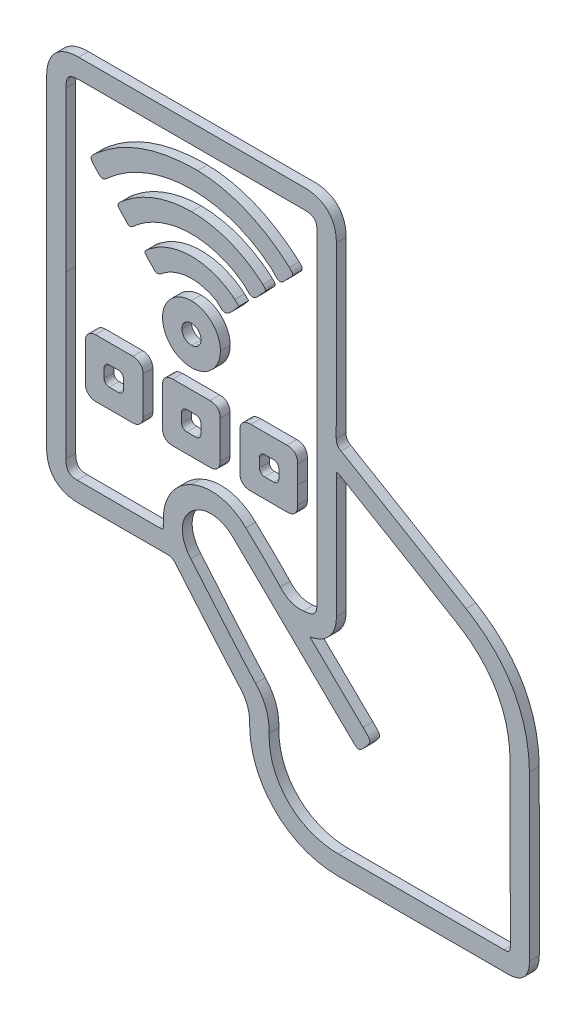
from build123d import *

# Parameters (mm, degrees)
BOSS_EXTRU_1_DEPTH   = 0.65
BOSS_EXTRU_1_2_DEPTH = 0.65
BOSS_EXTRU_1_3_DEPTH = 0.65
BOSS_EXTRU_1_4_DEPTH = 0.65
BOSS_EXTRU_1_5_DEPTH = 0.65
BOSS_EXTRU_1_6_DEPTH = 0.65
BOSS_EXTRU_1_7_DEPTH = 0.65
BOSS_EXTRU_1_8_DEPTH = 0.65


with BuildPart() as part:
    # Esquisse1 → Boss.-Extru.1 (new body)
    with BuildSketch(Plane.XY):
        with BuildLine():
            Line((-10.749684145, -2.86533547), (-13.245871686, -2.86533547))
            ThreePointArc((-13.245871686, -2.86533547), (-13.72387587, -3.063331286), (-13.921871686, -3.54133547))
            Line((-13.921871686, -3.54133547), (-13.921871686, -6.037051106))
            ThreePointArc((-13.921871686, -6.037051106), (-13.72387587, -6.51505529), (-13.245871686, -6.713051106))
            Line((-13.245871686, -6.713051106), (-10.749684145, -6.713051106))
            ThreePointArc((-10.749684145, -6.713051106), (-10.271679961, -6.51505529), (-10.073684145, -6.037051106))
            Line((-10.073684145, -6.037051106), (-10.073684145, -3.54133547))
            ThreePointArc((-10.073684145, -3.54133547), (-10.271679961, -3.063331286), (-10.749684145, -2.86533547))
        make_face()
        with BuildLine():
            Line((-12.667503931, -5.093877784), (-12.667503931, -4.48460685))
            ThreePointArc((-12.667503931, -4.48460685), (-12.568506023, -4.245604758), (-12.329503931, -4.14660685))
            Line((-12.329503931, -4.14660685), (-11.720236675, -4.14660685))
            ThreePointArc((-11.720236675, -4.14660685), (-11.481234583, -4.245604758), (-11.382236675, -4.48460685))
            Line((-11.382236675, -4.48460685), (-11.382236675, -5.093877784))
            ThreePointArc((-11.382236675, -5.093877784), (-11.481234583, -5.332879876), (-11.720236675, -5.431877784))
            Line((-11.720236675, -5.431877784), (-12.329503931, -5.431877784))
            ThreePointArc((-12.329503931, -5.431877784), (-12.568506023, -5.332879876), (-12.667503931, -5.093877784))
        make_face(mode=Mode.SUBTRACT)
    extrude(amount=BOSS_EXTRU_1_DEPTH)


with BuildPart() as body_2:
    # Esquisse1 → Boss.-Extru.1 2 (new body)
    with BuildSketch(Plane.XY):
        with BuildLine():
            add(Edge.make_bspline(
                [(-16.49617225, -10.989971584), (-16.497059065, -7.416236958), (-16.496468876, -3.842503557), (-16.496468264, -0.268770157)],
                knots=[17, 17, 17, 17, 18, 18, 18, 18], degree=3))
            add(Edge.make_bspline(
                [(-14.326440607, -13.143272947), (-15.721414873, -13.142650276), (-16.495829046, -12.37473124), (-16.49617225, -10.989971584)],
                knots=[16, 16, 16, 16, 17, 17, 17, 17], degree=3))
            add(Edge.make_bspline(
                [(-8.463938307, -13.137999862), (-10.418067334, -13.147724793), (-12.372263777, -13.144143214), (-14.326440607, -13.143272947)],
                knots=[15, 15, 15, 15, 16, 16, 16, 16], degree=3))
            add(Edge.make_bspline(
                [(-7.922912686, -13.388396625), (-8.076073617, -13.207383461), (-8.227213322, -13.136820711), (-8.463938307, -13.137999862)],
                knots=[14, 14, 14, 14, 15, 15, 15, 15], degree=3))
            add(Edge.make_bspline(
                [(-3.613993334, -18.419304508), (-5.080749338, -16.769338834), (-6.496633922, -15.07402365), (-7.922912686, -13.388396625)],
                knots=[13, 13, 13, 13, 14, 14, 14, 14], degree=3))
            add(Edge.make_bspline(
                [(-2.985949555, -20.135226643), (-2.981196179, -19.449789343), (-3.154215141, -18.936510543), (-3.613993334, -18.419304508)],
                knots=[12, 12, 12, 12, 13, 13, 13, 13], degree=3))
            add(Edge.make_bspline(
                [(2.851735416, -25.994332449), (-0.45095137, -25.98747082), (-3.008848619, -23.437504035), (-2.985949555, -20.135226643)],
                knots=[11, 11, 11, 11, 12, 12, 12, 12], degree=3))
            add(Edge.make_bspline(
                [(14.175245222, -25.99559495), (10.400741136, -25.996999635), (6.626222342, -26.002177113), (2.851735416, -25.994332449)],
                knots=[10, 10, 10, 10, 11, 11, 11, 11], degree=3))
            add(Edge.make_bspline(
                [(15.634705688, -24.530741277), (15.634350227, -25.486995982), (15.128178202, -25.99524194), (14.175245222, -25.99559495)],
                knots=[9, 9, 9, 9, 10, 10, 10, 10], degree=3))
            add(Edge.make_bspline(
                [(15.627927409, -13.648986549), (15.659487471, -17.275983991), (15.636046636, -20.903469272), (15.634705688, -24.530741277)],
                knots=[8, 8, 8, 8, 9, 9, 9, 9], degree=3))
            add(Edge.make_bspline(
                [(11.415056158, -6.323627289), (14.173220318, -7.977765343), (15.599939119, -10.432576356), (15.627927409, -13.648986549)],
                knots=[7, 7, 7, 7, 8, 8, 8, 8], degree=3))
            add(Edge.make_bspline(
                [(3.094802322, -1.401946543), (5.872722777, -3.034872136), (8.651648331, -4.666341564), (11.415056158, -6.323627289)],
                knots=[6, 6, 6, 6, 7, 7, 7, 7], degree=3))
            add(Edge.make_bspline(
                [(2.776103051, -0.835961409), (2.775404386, -1.110247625), (2.85778071, -1.262616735), (3.094802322, -1.401946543)],
                knots=[5, 5, 5, 5, 6, 6, 6, 6], degree=3))
            add(Edge.make_bspline(
                [(2.782028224, 10.44738372), (2.783555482, 6.686263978), (2.785698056, 2.925134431), (2.776103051, -0.835961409)],
                knots=[4, 4, 4, 4, 5, 5, 5, 5], degree=3))
            add(Edge.make_bspline(
                [(-14.363631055, 12.561543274), (-9.357727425, 12.562417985), (-4.351823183, 12.562440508), (0.654079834, 12.56152305), (1.991626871, 12.561277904), (2.781488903, 11.777324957), (2.782028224, 10.44738372)],
                knots=[2, 2, 2, 2, 3, 3, 3, 4, 4, 4, 4], degree=3))
            add(Edge.make_bspline(
                [(-16.496205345, 10.412276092), (-16.495905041, 11.778505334), (-15.71979017, 12.561306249), (-14.363631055, 12.561543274)],
                knots=[1, 1, 1, 1, 2, 2, 2, 2], degree=3))
            add(Edge.make_bspline(
                [(-16.496468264, -0.268770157), (-16.496468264, 3.291578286), (-16.496988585, 6.851927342), (-16.496205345, 10.412276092)],
                knots=[0, 0, 0, 0, 1, 1, 1, 1], degree=3))
        make_face()
        with BuildLine():
            add(Edge.make_bspline(
                [(2.033316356, -12.730035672), (1.757390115, -12.954866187), (1.42438659, -13.052000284), (1.024257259, -13.156086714)],
                knots=[18, 18, 18, 18, 19, 19, 19, 19], degree=3))
            add(Edge.make_bspline(
                [(2.78390604, -11.117351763), (2.784761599, -11.775766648), (2.544759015, -12.313305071), (2.033316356, -12.730035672)],
                knots=[17, 17, 17, 17, 18, 18, 18, 18], degree=3))
            add(Edge.make_bspline(
                [(2.782569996, -3.204998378), (2.78254303, -5.842450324), (2.780481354, -8.479904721), (2.78390604, -11.117351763)],
                knots=[16, 16, 16, 16, 17, 17, 17, 17], degree=3))
            add(Edge.make_bspline(
                [(2.782572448, -2.780956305), (2.782572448, -2.918190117), (2.782572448, -3.061594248), (2.782569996, -3.204998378)],
                knots=[15, 15, 15, 15, 16, 16, 16, 16], degree=3))
            add(Edge.make_bspline(
                [(3.103232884, -2.889867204), (3.015845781, -2.838148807), (2.938928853, -2.746702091), (2.782572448, -2.780956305)],
                knots=[14, 14, 14, 14, 15, 15, 15, 15], degree=3))
            add(Edge.make_bspline(
                [(10.8320432, -7.476905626), (8.268343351, -5.927089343), (5.681408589, -4.4156923), (3.103232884, -2.889867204)],
                knots=[13, 13, 13, 13, 14, 14, 14, 14], degree=3))
            add(Edge.make_bspline(
                [(14.344712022, -13.665835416), (14.328397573, -10.960411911), (13.147680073, -8.876761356), (10.8320432, -7.476905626)],
                knots=[12, 12, 12, 12, 13, 13, 13, 13], degree=3))
            add(Edge.make_bspline(
                [(14.358548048, -24.30920307), (14.344577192, -20.76144899), (14.36610344, -17.213515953), (14.344712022, -13.665835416)],
                knots=[11, 11, 11, 11, 12, 12, 12, 12], degree=3))
            add(Edge.make_bspline(
                [(13.933693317, -24.718383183), (14.257087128, -24.719420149), (14.359908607, -24.654873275), (14.358548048, -24.30920307)],
                knots=[10, 10, 10, 10, 11, 11, 11, 11], degree=3))
            add(Edge.make_bspline(
                [(2.928718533, -24.709636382), (6.597045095, -24.714703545), (10.265398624, -24.706616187), (13.933693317, -24.718383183)],
                knots=[9, 9, 9, 9, 10, 10, 10, 10], degree=3))
            add(Edge.make_bspline(
                [(-1.694100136, -20.076239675), (-1.746595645, -22.755324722), (0.243262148, -24.705927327), (2.928718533, -24.709636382)],
                knots=[8, 8, 8, 8, 9, 9, 9, 9], degree=3))
            add(Edge.make_bspline(
                [(-2.58663901, -17.635671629), (-1.923676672, -18.363462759), (-1.674981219, -19.100566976), (-1.694100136, -20.076239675)],
                knots=[7, 7, 7, 7, 8, 8, 8, 8], degree=3))
            add(Edge.make_bspline(
                [(-6.903512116, -12.609686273), (-5.468895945, -14.289040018), (-4.073217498, -16.003729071), (-2.58663901, -17.635671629)],
                knots=[6, 6, 6, 6, 7, 7, 7, 7], degree=3))
            add(Edge.make_bspline(
                [(-6.880095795, -9.868459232), (-7.647899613, -10.588849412), (-7.655656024, -11.729233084), (-6.903512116, -12.609686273)],
                knots=[5, 5, 5, 5, 6, 6, 6, 6], degree=3))
            add(Edge.make_bspline(
                [(-4.097694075, -9.966667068), (-4.92037009, -9.167832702), (-6.099173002, -9.135760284), (-6.880095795, -9.868459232)],
                knots=[4, 4, 4, 4, 5, 5, 5, 5], degree=3))
            add(Edge.make_bspline(
                [(3.923375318, -17.791079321), (1.259915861, -15.172530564), (-1.418029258, -12.568683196), (-4.097694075, -9.966667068)],
                knots=[3, 3, 3, 3, 4, 4, 4, 4], degree=3))
            add(Edge.make_bspline(
                [(4.598009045, -17.774142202), (4.343601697, -18.05955068), (4.205226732, -18.068177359), (3.923375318, -17.791079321)],
                knots=[2, 2, 2, 2, 3, 3, 3, 3], degree=3))
            add(Edge.make_bspline(
                [(4.56050665, -16.592331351), (5.160937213, -17.175111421), (5.145740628, -17.159667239), (4.598009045, -17.774142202)],
                knots=[1, 1, 1, 1, 2, 2, 2, 2], degree=3))
            add(Edge.make_bspline(
                [(1.024257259, -13.156086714), (2.23858424, -14.336215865), (3.398930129, -15.464908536), (4.56050665, -16.592331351)],
                knots=[0, 0, 0, 0, 1, 1, 1, 1], degree=3))
        make_face(mode=Mode.SUBTRACT)
        with BuildLine():
            add(Edge.make_bspline(
                [(-15.211055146, 10.350748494), (-15.211384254, 6.817302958), (-15.211202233, 3.283857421), (-15.211188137, -0.249588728)],
                knots=[13, 13, 13, 13, 14, 14, 14, 14], degree=3))
            add(Edge.make_bspline(
                [(-14.290096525, 11.276471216), (-15.026343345, 11.276427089), (-15.210986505, 11.090735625), (-15.211055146, 10.350748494)],
                knots=[12, 12, 12, 12, 13, 13, 13, 13], degree=3))
            add(Edge.make_bspline(
                [(0.60658775, 11.276368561), (-4.358974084, 11.276845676), (-9.324534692, 11.276768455), (-14.290096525, 11.276471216)],
                knots=[11, 11, 11, 11, 12, 12, 12, 12], degree=3))
            add(Edge.make_bspline(
                [(1.496959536, 10.39995905), (1.496905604, 11.077370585), (1.294209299, 11.276302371), (0.60658775, 11.276368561)],
                knots=[10, 10, 10, 10, 11, 11, 11, 11], degree=3))
            add(Edge.make_bspline(
                [(1.497052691, -10.961323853), (1.497459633, -3.840896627), (1.497508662, 3.279531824), (1.496959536, 10.39995905)],
                knots=[9, 9, 9, 9, 10, 10, 10, 10], degree=3))
            add(Edge.make_bspline(
                [(0.586931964, -11.870814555), (1.297670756, -11.814359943), (1.497011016, -11.665497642), (1.497052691, -10.961323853)],
                knots=[8, 8, 8, 8, 9, 9, 9, 9], degree=3))
            add(Edge.make_bspline(
                [(-0.949261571, -11.252672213), (-0.511465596, -11.727487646), (-0.053454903, -11.921677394), (0.586931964, -11.870814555)],
                knots=[7, 7, 7, 7, 8, 8, 8, 8], degree=3))
            add(Edge.make_bspline(
                [(-3.238506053, -9.000525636), (-2.468392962, -9.744390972), (-1.67403986, -10.466612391), (-0.949261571, -11.252672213)],
                knots=[6, 6, 6, 6, 7, 7, 7, 7], degree=3))
            add(Edge.make_bspline(
                [(-6.901438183, -8.333096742), (-5.654454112, -7.751687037), (-4.273908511, -8.000407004), (-3.238506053, -9.000525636)],
                knots=[5, 5, 5, 5, 6, 6, 6, 6], degree=3))
            add(Edge.make_bspline(
                [(-8.721343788, -11.573455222), (-8.842227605, -10.145076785), (-8.139224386, -8.910216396), (-6.901438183, -8.333096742)],
                knots=[4, 4, 4, 4, 5, 5, 5, 5], degree=3))
            add(Edge.make_bspline(
                [(-8.991336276, -11.862205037), (-8.768135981, -11.863090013), (-8.70061549, -11.81839259), (-8.721343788, -11.573455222)],
                knots=[3, 3, 3, 3, 4, 4, 4, 4], degree=3))
            add(Edge.make_bspline(
                [(-14.452095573, -11.856385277), (-12.631847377, -11.86089841), (-10.811567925, -11.854973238), (-8.991336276, -11.862205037)],
                knots=[2, 2, 2, 2, 3, 3, 3, 3], degree=3))
            add(Edge.make_bspline(
                [(-15.210700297, -11.01053686), (-15.210534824, -11.611783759), (-14.998065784, -11.855032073), (-14.452095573, -11.856385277)],
                knots=[1, 1, 1, 1, 2, 2, 2, 2], degree=3))
            add(Edge.make_bspline(
                [(-15.211188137, -0.249588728), (-15.211188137, -3.83657103), (-15.211685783, -7.423554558), (-15.210700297, -11.01053686)],
                knots=[0, 0, 0, 0, 1, 1, 1, 1], degree=3))
        make_face(mode=Mode.SUBTRACT)
    extrude(amount=BOSS_EXTRU_1_2_DEPTH)


with BuildPart() as body_3:
    # Esquisse1 → Boss.-Extru.1 3 (new body)
    with BuildSketch(Plane.XY):
        with BuildLine():
            add(Edge.make_bspline(
                [(-13.012537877, 7.768000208), (-11.261474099, 9.217998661), (-9.106901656, 9.994384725), (-6.449092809, 9.990472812)],
                knots=[7, 7, 7, 7, 8, 8, 8, 8], degree=3))
            add(Edge.make_bspline(
                [(-13.081888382, 6.563262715), (-13.693800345, 7.205114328), (-13.703736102, 7.195641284), (-13.012537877, 7.768000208)],
                knots=[6, 6, 6, 6, 7, 7, 7, 7], degree=3))
            add(Edge.make_bspline(
                [(-12.459903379, 6.534012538), (-12.735209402, 6.283005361), (-12.857453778, 6.327847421), (-13.081888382, 6.563262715)],
                knots=[5, 5, 5, 5, 6, 6, 6, 6], degree=3))
            add(Edge.make_bspline(
                [(-1.579298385, 6.832378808), (-4.741631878, 9.436964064), (-9.404650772, 9.319600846), (-12.459903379, 6.534012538)],
                knots=[4, 4, 4, 4, 5, 5, 5, 5], degree=3))
            add(Edge.make_bspline(
                [(-0.941247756, 6.33997049), (-1.1748741, 6.308718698), (-1.365411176, 6.656216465), (-1.579298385, 6.832378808)],
                knots=[3, 3, 3, 3, 4, 4, 4, 4], degree=3))
            add(Edge.make_bspline(
                [(-0.325355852, 6.878396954), (-0.544430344, 6.706802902), (-0.71686831, 6.369984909), (-0.941247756, 6.33997049)],
                knots=[2, 2, 2, 2, 3, 3, 3, 3], degree=3))
            add(Edge.make_bspline(
                [(-0.343736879, 7.462383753), (-0.105124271, 7.24855967), (-0.045723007, 7.097419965), (-0.325355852, 6.878396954)],
                knots=[1, 1, 1, 1, 2, 2, 2, 2], degree=3))
            add(Edge.make_bspline(
                [(-6.449092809, 9.990472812), (-4.364081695, 9.951883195), (-2.195129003, 9.121448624), (-0.343736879, 7.462383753)],
                knots=[0, 0, 0, 0, 1, 1, 1, 1], degree=3))
        make_face()
    extrude(amount=BOSS_EXTRU_1_3_DEPTH)


with BuildPart() as body_4:
    # Esquisse1 → Boss.-Extru.1 4 (new body)
    with BuildSketch(Plane.XY):
        with BuildLine():
            add(Edge.make_bspline(
                [(-11.306731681, 5.840137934), (-10.009408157, 6.881642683), (-8.524338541, 7.398967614), (-6.856688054, 7.425488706)],
                knots=[8, 8, 8, 8, 9, 9, 9, 9], degree=3))
            add(Edge.make_bspline(
                [(-11.374633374, 4.872071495), (-11.877531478, 5.377183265), (-11.879828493, 5.380050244), (-11.306731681, 5.840137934)],
                knots=[7, 7, 7, 7, 8, 8, 8, 8], degree=3))
            add(Edge.make_bspline(
                [(-11.206197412, 4.700558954), (-11.253239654, 4.764433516), (-11.318035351, 4.815225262), (-11.374633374, 4.872071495)],
                knots=[6, 6, 6, 6, 7, 7, 7, 7], degree=3))
            add(Edge.make_bspline(
                [(-10.674924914, 4.678991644), (-10.904425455, 4.473744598), (-11.034846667, 4.467899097), (-11.206197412, 4.700558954)],
                knots=[5, 5, 5, 5, 6, 6, 6, 6], degree=3))
            add(Edge.make_bspline(
                [(-3.423664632, 5.010018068), (-5.618871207, 6.621145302), (-8.643131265, 6.496076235), (-10.674924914, 4.678991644)],
                knots=[4, 4, 4, 4, 5, 5, 5, 5], degree=3))
            add(Edge.make_bspline(
                [(-2.740963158, 4.52824356), (-2.999133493, 4.473562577), (-3.19239659, 4.840282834), (-3.423664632, 5.010018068)],
                knots=[3, 3, 3, 3, 4, 4, 4, 4], degree=3))
            add(Edge.make_bspline(
                [(-2.097364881, 5.104250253), (-2.323234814, 4.917871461), (-2.49748931, 4.57981058), (-2.740963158, 4.52824356)],
                knots=[2, 2, 2, 2, 3, 3, 3, 3], degree=3))
            add(Edge.make_bspline(
                [(-2.107418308, 5.594371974), (-1.894648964, 5.407519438), (-1.874404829, 5.288228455), (-2.097364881, 5.104250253)],
                knots=[1, 1, 1, 1, 2, 2, 2, 2], degree=3))
            add(Edge.make_bspline(
                [(-6.856688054, 7.425488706), (-5.05329424, 7.397516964), (-3.469913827, 6.7909026), (-2.107418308, 5.594371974)],
                knots=[0, 0, 0, 0, 1, 1, 1, 1], degree=3))
        make_face()
    extrude(amount=BOSS_EXTRU_1_4_DEPTH)


with BuildPart() as body_5:
    # Esquisse1 → Boss.-Extru.1 5 (new body)
    with BuildSketch(Plane.XY):
        with BuildLine():
            add(Edge.make_bspline(
                [(-8.791823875, -6.020052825), (-8.803175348, -5.605397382), (-8.794283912, -5.190187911), (-8.794236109, -4.775221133)],
                knots=[8, 8, 8, 8, 9, 9, 9, 9], degree=3))
            add(Edge.make_bspline(
                [(-8.115795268, -6.702566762), (-8.541699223, -6.696680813), (-8.780091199, -6.448685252), (-8.791823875, -6.020052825)],
                knots=[7, 7, 7, 7, 8, 8, 8, 8], degree=3))
            add(Edge.make_bspline(
                [(-5.626085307, -6.702917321), (-6.455880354, -6.713583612), (-7.286021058, -6.71403468), (-8.115795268, -6.702566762)],
                knots=[6, 6, 6, 6, 7, 7, 7, 7], degree=3))
            add(Edge.make_bspline(
                [(-4.943708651, -6.02672324), (-4.949605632, -6.452217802), (-5.198096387, -6.697418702), (-5.626085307, -6.702917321)],
                knots=[5, 5, 5, 5, 6, 6, 6, 6], degree=3))
            add(Edge.make_bspline(
                [(-4.943345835, -3.537014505), (-4.932608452, -4.366807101), (-4.93221009, -5.19694903), (-4.943708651, -6.02672324)],
                knots=[4, 4, 4, 4, 5, 5, 5, 5], degree=3))
            add(Edge.make_bspline(
                [(-5.619470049, -2.855213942), (-5.193957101, -2.860924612), (-4.948892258, -3.108477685), (-4.943345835, -3.537014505)],
                knots=[3, 3, 3, 3, 4, 4, 4, 4], degree=3))
            add(Edge.make_bspline(
                [(-8.109184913, -2.854925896), (-7.279386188, -2.844449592), (-6.449252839, -2.844078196), (-5.619470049, -2.855213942)],
                knots=[2, 2, 2, 2, 3, 3, 3, 3], degree=3))
            add(Edge.make_bspline(
                [(-8.791568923, -3.530399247), (-8.77915842, -3.103949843), (-8.538468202, -2.860344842), (-8.109184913, -2.854925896)],
                knots=[1, 1, 1, 1, 2, 2, 2, 2], degree=3))
            add(Edge.make_bspline(
                [(-8.794236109, -4.775221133), (-8.794189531, -4.360255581), (-8.803633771, -3.945014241), (-8.791568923, -3.530399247)],
                knots=[0, 0, 0, 0, 1, 1, 1, 1], degree=3))
        make_face()
        with BuildLine():
            Line((-7.513003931, -5.093877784), (-7.513003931, -4.48460685))
            ThreePointArc((-7.513003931, -4.48460685), (-7.414006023, -4.245604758), (-7.175003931, -4.14660685))
            Line((-7.175003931, -4.14660685), (-7.066854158, -4.14660685))
            Line((-7.066854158, -4.14660685), (-6.565736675, -4.14660685))
            ThreePointArc((-6.565736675, -4.14660685), (-6.326734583, -4.245604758), (-6.227736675, -4.48460685))
            Line((-6.227736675, -4.48460685), (-6.227736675, -5.093877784))
            ThreePointArc((-6.227736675, -5.093877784), (-6.326734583, -5.332879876), (-6.565736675, -5.431877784))
            Line((-6.565736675, -5.431877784), (-7.175003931, -5.431877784))
            ThreePointArc((-7.175003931, -5.431877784), (-7.414006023, -5.332879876), (-7.513003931, -5.093877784))
        make_face(mode=Mode.SUBTRACT)
    extrude(amount=BOSS_EXTRU_1_5_DEPTH)


with BuildPart() as body_6:
    # Esquisse1 → Boss.-Extru.1 6 (new body)
    with BuildSketch(Plane.XY):
        with BuildLine():
            add(Edge.make_bspline(
                [(0.210275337, -3.593733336), (0.217705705, -3.995177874), (0.211800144, -4.39687001), (0.211832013, -4.79845183)],
                knots=[8, 8, 8, 8, 9, 9, 9, 9], degree=3))
            add(Edge.make_bspline(
                [(-0.501949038, -2.864036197), (-0.032492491, -2.869135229), (0.201413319, -3.114766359), (0.210275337, -3.593733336)],
                knots=[7, 7, 7, 7, 8, 8, 8, 8], degree=3))
            add(Edge.make_bspline(
                [(-2.911398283, -2.863476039), (-2.10829593, -2.856434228), (-1.305017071, -2.855313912), (-0.501949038, -2.864036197)],
                knots=[6, 6, 6, 6, 7, 7, 7, 7], degree=3))
            add(Edge.make_bspline(
                [(-3.64105007, -3.574467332), (-3.635924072, -3.104586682), (-3.390655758, -2.867677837), (-2.911398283, -2.863476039)],
                knots=[5, 5, 5, 5, 6, 6, 6, 6], degree=3))
            add(Edge.make_bspline(
                [(-3.641609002, -5.983917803), (-3.648671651, -5.180815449), (-3.649806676, -4.377537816), (-3.64105007, -3.574467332)],
                knots=[4, 4, 4, 4, 5, 5, 5, 5], degree=3))
            add(Edge.make_bspline(
                [(-2.93061771, -6.714345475), (-3.399816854, -6.709087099), (-3.63739985, -6.462573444), (-3.641609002, -5.983917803)],
                knots=[3, 3, 3, 3, 4, 4, 4, 4], degree=3))
            add(Edge.make_bspline(
                [(-0.521170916, -6.714889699), (-1.324263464, -6.722396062), (-2.127554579, -6.723344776), (-2.93061771, -6.714345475)],
                knots=[2, 2, 2, 2, 3, 3, 3, 3], degree=3))
            add(Edge.make_bspline(
                [(0.210687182, -5.96302158), (0.203038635, -6.467152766), (-0.028236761, -6.71028341), (-0.521170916, -6.714889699)],
                knots=[1, 1, 1, 1, 2, 2, 2, 2], degree=3))
            add(Edge.make_bspline(
                [(0.211832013, -4.79845183), (0.21186143, -5.186647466), (0.216575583, -5.574915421), (0.210687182, -5.96302158)],
                knots=[0, 0, 0, 0, 1, 1, 1, 1], degree=3))
        make_face()
        with BuildLine():
            Line((-2.331575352, -5.093877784), (-2.331575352, -4.48460685))
            ThreePointArc((-2.331575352, -4.48460685), (-2.232577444, -4.245604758), (-1.993575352, -4.14660685))
            Line((-1.993575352, -4.14660685), (-1.384308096, -4.14660685))
            ThreePointArc((-1.384308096, -4.14660685), (-1.145306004, -4.245604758), (-1.046308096, -4.48460685))
            Line((-1.046308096, -4.48460685), (-1.046308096, -5.093877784))
            ThreePointArc((-1.046308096, -5.093877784), (-1.145306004, -5.332879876), (-1.384308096, -5.431877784))
            Line((-1.384308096, -5.431877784), (-1.993575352, -5.431877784))
            ThreePointArc((-1.993575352, -5.431877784), (-2.232577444, -5.332879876), (-2.331575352, -5.093877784))
        make_face(mode=Mode.SUBTRACT)
    extrude(amount=BOSS_EXTRU_1_6_DEPTH)


with BuildPart() as body_7:
    # Esquisse1 → Boss.-Extru.1 7 (new body)
    with BuildSketch(Plane.XY):
        with BuildLine():
            add(Edge.make_bspline(
                [(-8.783257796, 0.364197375), (-8.783097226, 1.408857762), (-7.912367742, 2.278979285), (-6.867744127, 2.278370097)],
                knots=[3, 3, 3, 3, 4, 4, 4, 4], degree=3))
            add(Edge.make_bspline(
                [(-6.848324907, -1.572816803), (-7.914094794, -1.577532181), (-8.78342327, -0.707267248), (-8.783257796, 0.364197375)],
                knots=[2, 2, 2, 2, 3, 3, 3, 3], degree=3))
            add(Edge.make_bspline(
                [(-4.93220205, 0.341956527), (-4.936840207, -0.707448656), (-5.798170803, -1.568172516), (-6.848324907, -1.572816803)],
                knots=[1, 1, 1, 1, 2, 2, 2, 2], degree=3))
            add(Edge.make_bspline(
                [(-6.867744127, 2.278370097), (-5.79645846, 2.277746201), (-4.927487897, 1.408384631), (-4.93220205, 0.341956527)],
                knots=[0, 0, 0, 0, 1, 1, 1, 1], degree=3))
        make_face()
        with BuildLine():
            add(Edge.make_bspline(
                [(-6.850810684, -0.287929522), (-6.505304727, -0.284101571), (-6.218802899, 0.003791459), (-6.21747666, 0.348479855)],
                knots=[3, 3, 3, 3, 4, 4, 4, 4], degree=3))
            add(Edge.make_bspline(
                [(-7.497304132, 0.335373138), (-7.488108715, -0.009453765), (-7.195313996, -0.291747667), (-6.850810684, -0.287929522)],
                knots=[2, 2, 2, 2, 3, 3, 3, 3], degree=3))
            add(Edge.make_bspline(
                [(-6.844557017, 0.991580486), (-7.2049519, 0.999993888), (-7.506931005, 0.696415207), (-7.497304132, 0.335373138)],
                knots=[1, 1, 1, 1, 2, 2, 2, 2], degree=3))
            add(Edge.make_bspline(
                [(-6.21747666, 0.348479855), (-6.21614797, 0.693683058), (-6.498753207, 0.983509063), (-6.844557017, 0.991580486)],
                knots=[0, 0, 0, 0, 1, 1, 1, 1], degree=3))
        make_face(mode=Mode.SUBTRACT)
    extrude(amount=BOSS_EXTRU_1_7_DEPTH)


with BuildPart() as body_8:
    # Esquisse1 → Boss.-Extru.1 8 (new body)
    with BuildSketch(Plane.XY):
        with BuildLine():
            add(Edge.make_bspline(
                [(-3.974603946, 3.797745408), (-3.88386325, 3.721067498), (-3.801380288, 3.634616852), (-3.701527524, 3.539881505)],
                knots=[8, 8, 8, 8, 9, 9, 9, 9], degree=3))
            add(Edge.make_bspline(
                [(-9.536341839, 3.956464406), (-7.870136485, 5.201181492), (-5.558045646, 5.135755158), (-3.974603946, 3.797745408)],
                knots=[7, 7, 7, 7, 8, 8, 8, 8], degree=3))
            add(Edge.make_bspline(
                [(-9.611107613, 3.108383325), (-10.068979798, 3.55856774), (-10.068994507, 3.558553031), (-9.536341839, 3.956464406)],
                knots=[6, 6, 6, 6, 7, 7, 7, 7], degree=3))
            add(Edge.make_bspline(
                [(-9.441492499, 2.93830366), (-9.488752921, 3.00189324), (-9.553950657, 3.052186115), (-9.611107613, 3.108383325)],
                knots=[5, 5, 5, 5, 6, 6, 6, 6], degree=3))
            add(Edge.make_bspline(
                [(-8.806992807, 2.880275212), (-9.091907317, 2.653177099), (-9.248920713, 2.679188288), (-9.441492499, 2.93830366)],
                knots=[4, 4, 4, 4, 5, 5, 5, 5], degree=3))
            add(Edge.make_bspline(
                [(-5.235109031, 3.13504415), (-6.3806616, 3.774886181), (-7.763742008, 3.711826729), (-8.806992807, 2.880275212)],
                knots=[3, 3, 3, 3, 4, 4, 4, 4], degree=3))
            add(Edge.make_bspline(
                [(-4.491601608, 2.749449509), (-4.817879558, 2.593088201), (-4.988466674, 2.997283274), (-5.235109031, 3.13504415)],
                knots=[2, 2, 2, 2, 3, 3, 3, 3], degree=3))
            add(Edge.make_bspline(
                [(-3.827206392, 3.379087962), (-4.044231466, 3.161606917), (-4.229588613, 2.875013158), (-4.491601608, 2.749449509)],
                knots=[1, 1, 1, 1, 2, 2, 2, 2], degree=3))
            add(Edge.make_bspline(
                [(-3.701527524, 3.539881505), (-3.749155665, 3.478235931), (-3.78294778, 3.423440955), (-3.827206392, 3.379087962)],
                knots=[0, 0, 0, 0, 1, 1, 1, 1], degree=3))
        make_face()
    extrude(amount=BOSS_EXTRU_1_8_DEPTH)


solid = Compound([part.part, body_2.part, body_3.part, body_4.part, body_5.part, body_6.part, body_7.part, body_8.part])
